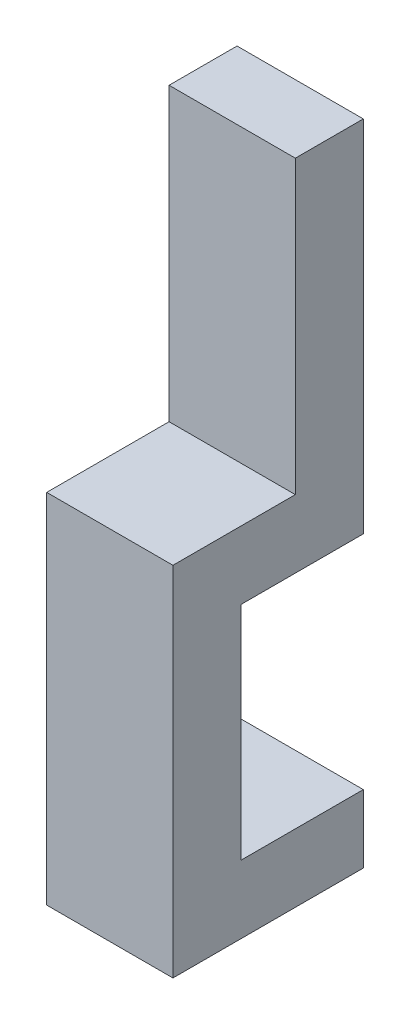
from build123d import *

# Parameters (mm, degrees)
BOSS_EXTRUDE7_DEPTH = 13


with BuildPart() as part:
    # Sketch1 → Boss-Extrude7 (new body)
    with BuildSketch(Plane(origin=(0, 0, 0), x_dir=(0, 0, -1), z_dir=(1, 0, 0))):
        Polygon((-46.790151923, 5.1614396), (-34.190151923, 5.1614396), (-34.190151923, 12.1614396), (-34.190151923, 42.1614396), (-41.190151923, 42.1614396), (-41.190151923, 12.1614396), (-53.790151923, 12.1614396), (-53.790151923, 0.1614396), (-53.790151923, -12.6385604), (-53.790151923, -24.6385604), (-41.790151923, -24.6385604), (-34.190151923, -24.6385604), (-34.190151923, -17.6385604), (-46.790151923, -17.6385604), align=None)
    extrude(amount=BOSS_EXTRUDE7_DEPTH)


solid = part.part
